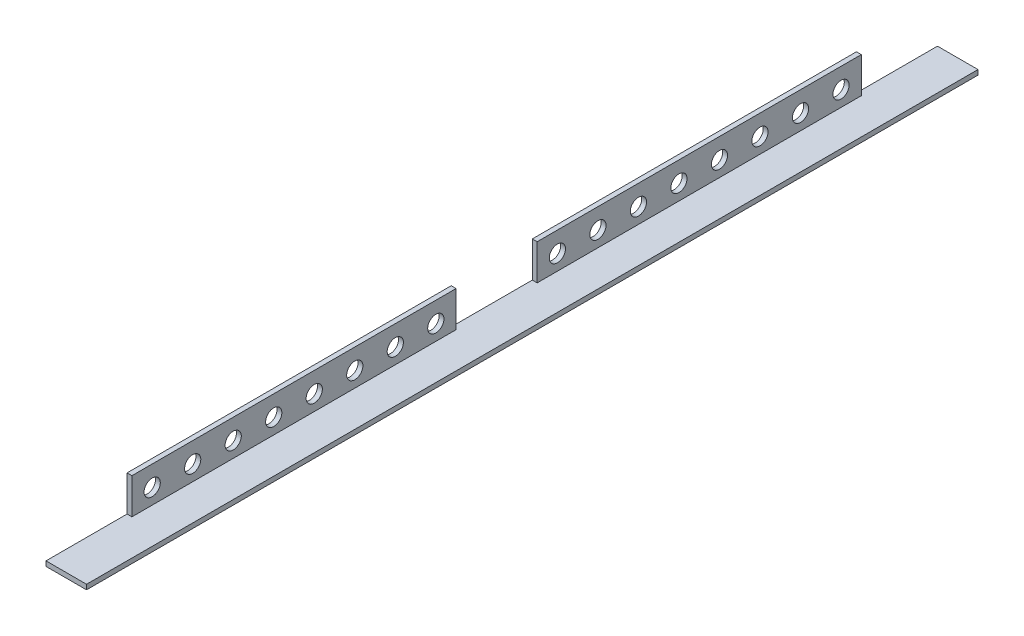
ISO-10303-21;
HEADER;
FILE_DESCRIPTION(('STEP AP214'),'2;1');
FILE_NAME('part.step','',(''),(''),'','','');
FILE_SCHEMA(('AUTOMOTIVE_DESIGN { 1 0 10303 214 1 1 1 1 }'));
ENDSEC;
DATA;
#1=APPLICATION_CONTEXT('core data for automotive mechanical design processes');
#2=APPLICATION_PROTOCOL_DEFINITION('international standard','automotive_design',2000,#1);
#3=PRODUCT_CONTEXT('',#1,'mechanical');
#4=PRODUCT('Part','Part','',(#3));
#5=PRODUCT_RELATED_PRODUCT_CATEGORY('part','',(#4));
#6=PRODUCT_DEFINITION_FORMATION('','',#4);
#7=PRODUCT_DEFINITION_CONTEXT('part definition',#1,'design');
#8=PRODUCT_DEFINITION('design','',#6,#7);
#9=PRODUCT_DEFINITION_SHAPE('','',#8);
#10=(LENGTH_UNIT() NAMED_UNIT(*) SI_UNIT(.MILLI.,.METRE.));
#11=(NAMED_UNIT(*) PLANE_ANGLE_UNIT() SI_UNIT($,.RADIAN.));
#12=(NAMED_UNIT(*) SI_UNIT($,.STERADIAN.) SOLID_ANGLE_UNIT());
#13=UNCERTAINTY_MEASURE_WITH_UNIT(LENGTH_MEASURE(1.E-05),#10,'distance_accuracy_value','');
#14=(GEOMETRIC_REPRESENTATION_CONTEXT(3) GLOBAL_UNCERTAINTY_ASSIGNED_CONTEXT((#13)) GLOBAL_UNIT_ASSIGNED_CONTEXT((#10,
#11,#12)) REPRESENTATION_CONTEXT('',''));
#15=CARTESIAN_POINT('',(0.,0.,0.));
#16=DIRECTION('',(0.,0.,1.));
#17=DIRECTION('',(1.,0.,0.));
#18=AXIS2_PLACEMENT_3D('',#15,#16,#17);
#19=CARTESIAN_POINT('',(-43.170695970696,0.,558.8));
#20=DIRECTION('',(0.,-1.,0.));
#21=DIRECTION('',(0.,0.,-1.));
#22=AXIS2_PLACEMENT_3D('',#19,#20,#21);
#23=PLANE('',#22);
#24=DIRECTION('',(0.,0.,-1.));
#25=VECTOR('',#24,1.);
#26=CARTESIAN_POINT('',(-40.122695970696,0.,558.8));
#27=LINE('',#26,#25);
#28=CARTESIAN_POINT('',(-40.122695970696,0.,254.));
#29=VERTEX_POINT('',#28);
#30=CARTESIAN_POINT('',(-40.122695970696,0.,50.8));
#31=VERTEX_POINT('',#30);
#32=EDGE_CURVE('E146',#29,#31,#27,.T.);
#33=ORIENTED_EDGE('',*,*,#32,.T.);
#34=DIRECTION('',(1.,0.,0.));
#35=VECTOR('',#34,1.);
#36=CARTESIAN_POINT('',(-598.922695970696,0.,50.8));
#37=LINE('',#36,#35);
#38=CARTESIAN_POINT('',(-43.170695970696,0.,50.8));
#39=VERTEX_POINT('',#38);
#40=EDGE_CURVE('E128',#39,#31,#37,.T.);
#41=ORIENTED_EDGE('',*,*,#40,.F.);
#42=DIRECTION('',(0.,0.,-1.));
#43=VECTOR('',#42,1.);
#44=CARTESIAN_POINT('',(-43.170695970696,0.,558.8));
#45=LINE('',#44,#43);
#46=CARTESIAN_POINT('',(-43.170695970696,0.,254.));
#47=VERTEX_POINT('',#46);
#48=EDGE_CURVE('E45',#47,#39,#45,.T.);
#49=ORIENTED_EDGE('',*,*,#48,.F.);
#50=DIRECTION('',(1.,0.,0.));
#51=VECTOR('',#50,1.);
#52=CARTESIAN_POINT('',(-598.922695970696,0.,254.));
#53=LINE('',#52,#51);
#54=EDGE_CURVE('E152',#47,#29,#53,.T.);
#55=ORIENTED_EDGE('',*,*,#54,.T.);
#56=EDGE_LOOP('',(#33,#41,#49,#55));
#57=FACE_BOUND('',#56,.T.);
#58=ADVANCED_FACE('F36',(#57),#23,.F.);
#59=CARTESIAN_POINT('',(-40.122695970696,0.,558.8));
#60=DIRECTION('',(-1.,0.,0.));
#61=DIRECTION('',(0.,0.,1.));
#62=AXIS2_PLACEMENT_3D('',#59,#60,#61);
#63=PLANE('',#62);
#64=CARTESIAN_POINT('',(-40.122695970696,-12.7,241.3));
#65=DIRECTION('',(-1.,0.,0.));
#66=DIRECTION('',(0.,0.,1.));
#67=AXIS2_PLACEMENT_3D('',#64,#65,#66);
#68=CIRCLE('',#67,5.07999999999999);
#69=CARTESIAN_POINT('',(-40.122695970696,-12.7,246.38));
#70=VERTEX_POINT('',#69);
#71=EDGE_CURVE('E599',#70,#70,#68,.T.);
#72=ORIENTED_EDGE('',*,*,#71,.T.);
#73=EDGE_LOOP('',(#72));
#74=FACE_BOUND('',#73,.T.);
#75=CARTESIAN_POINT('',(-40.122695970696,-12.7,215.9));
#76=DIRECTION('',(-1.,0.,0.));
#77=DIRECTION('',(0.,0.,1.));
#78=AXIS2_PLACEMENT_3D('',#75,#76,#77);
#79=CIRCLE('',#78,5.07999999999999);
#80=CARTESIAN_POINT('',(-40.122695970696,-12.7,220.98));
#81=VERTEX_POINT('',#80);
#82=EDGE_CURVE('E226',#81,#81,#79,.T.);
#83=ORIENTED_EDGE('',*,*,#82,.T.);
#84=EDGE_LOOP('',(#83));
#85=FACE_BOUND('',#84,.T.);
#86=CARTESIAN_POINT('',(-40.122695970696,-12.7,190.5));
#87=DIRECTION('',(-1.,0.,0.));
#88=DIRECTION('',(0.,0.,1.));
#89=AXIS2_PLACEMENT_3D('',#86,#87,#88);
#90=CIRCLE('',#89,5.07999999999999);
#91=CARTESIAN_POINT('',(-40.122695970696,-12.7,195.58));
#92=VERTEX_POINT('',#91);
#93=EDGE_CURVE('E232',#92,#92,#90,.T.);
#94=ORIENTED_EDGE('',*,*,#93,.T.);
#95=EDGE_LOOP('',(#94));
#96=FACE_BOUND('',#95,.T.);
#97=CARTESIAN_POINT('',(-40.122695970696,-12.7,165.1));
#98=DIRECTION('',(-1.,0.,0.));
#99=DIRECTION('',(0.,0.,1.));
#100=AXIS2_PLACEMENT_3D('',#97,#98,#99);
#101=CIRCLE('',#100,5.07999999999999);
#102=CARTESIAN_POINT('',(-40.122695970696,-12.7,170.18));
#103=VERTEX_POINT('',#102);
#104=EDGE_CURVE('E238',#103,#103,#101,.T.);
#105=ORIENTED_EDGE('',*,*,#104,.T.);
#106=EDGE_LOOP('',(#105));
#107=FACE_BOUND('',#106,.T.);
#108=CARTESIAN_POINT('',(-40.122695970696,-12.7,139.7));
#109=DIRECTION('',(-1.,0.,0.));
#110=DIRECTION('',(0.,0.,1.));
#111=AXIS2_PLACEMENT_3D('',#108,#109,#110);
#112=CIRCLE('',#111,5.07999999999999);
#113=CARTESIAN_POINT('',(-40.122695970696,-12.7,144.78));
#114=VERTEX_POINT('',#113);
#115=EDGE_CURVE('E244',#114,#114,#112,.T.);
#116=ORIENTED_EDGE('',*,*,#115,.T.);
#117=EDGE_LOOP('',(#116));
#118=FACE_BOUND('',#117,.T.);
#119=CARTESIAN_POINT('',(-40.122695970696,-12.7,114.3));
#120=DIRECTION('',(-1.,0.,0.));
#121=DIRECTION('',(0.,0.,1.));
#122=AXIS2_PLACEMENT_3D('',#119,#120,#121);
#123=CIRCLE('',#122,5.08);
#124=CARTESIAN_POINT('',(-40.122695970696,-12.7,119.38));
#125=VERTEX_POINT('',#124);
#126=EDGE_CURVE('E250',#125,#125,#123,.T.);
#127=ORIENTED_EDGE('',*,*,#126,.T.);
#128=EDGE_LOOP('',(#127));
#129=FACE_BOUND('',#128,.T.);
#130=CARTESIAN_POINT('',(-40.122695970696,-12.7,88.9));
#131=DIRECTION('',(-1.,0.,0.));
#132=DIRECTION('',(0.,0.,1.));
#133=AXIS2_PLACEMENT_3D('',#130,#131,#132);
#134=CIRCLE('',#133,5.08);
#135=CARTESIAN_POINT('',(-40.122695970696,-12.7,93.98));
#136=VERTEX_POINT('',#135);
#137=EDGE_CURVE('E256',#136,#136,#134,.T.);
#138=ORIENTED_EDGE('',*,*,#137,.T.);
#139=EDGE_LOOP('',(#138));
#140=FACE_BOUND('',#139,.T.);
#141=CARTESIAN_POINT('',(-40.122695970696,-12.7,63.5));
#142=DIRECTION('',(-1.,0.,0.));
#143=DIRECTION('',(0.,0.,1.));
#144=AXIS2_PLACEMENT_3D('',#141,#142,#143);
#145=CIRCLE('',#144,5.08);
#146=CARTESIAN_POINT('',(-40.122695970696,-12.7,68.58));
#147=VERTEX_POINT('',#146);
#148=EDGE_CURVE('E149',#147,#147,#145,.T.);
#149=ORIENTED_EDGE('',*,*,#148,.T.);
#150=EDGE_LOOP('',(#149));
#151=FACE_BOUND('',#150,.T.);
#152=DIRECTION('',(0.,0.,-1.));
#153=VECTOR('',#152,1.);
#154=CARTESIAN_POINT('',(-40.122695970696,-22.352,558.8));
#155=LINE('',#154,#153);
#156=CARTESIAN_POINT('',(-40.122695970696,-22.352,254.));
#157=VERTEX_POINT('',#156);
#158=CARTESIAN_POINT('',(-40.122695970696,-22.352,50.8));
#159=VERTEX_POINT('',#158);
#160=EDGE_CURVE('E148',#157,#159,#155,.T.);
#161=ORIENTED_EDGE('',*,*,#160,.T.);
#162=DIRECTION('',(0.,-1.,0.));
#163=VECTOR('',#162,1.);
#164=CARTESIAN_POINT('',(-40.122695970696,-22.352,50.8));
#165=LINE('',#164,#163);
#166=EDGE_CURVE('E132',#31,#159,#165,.T.);
#167=ORIENTED_EDGE('',*,*,#166,.F.);
#168=ORIENTED_EDGE('',*,*,#32,.F.);
#169=DIRECTION('',(0.,1.,0.));
#170=VECTOR('',#169,1.);
#171=CARTESIAN_POINT('',(-40.122695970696,-22.352,254.));
#172=LINE('',#171,#170);
#173=EDGE_CURVE('E271',#157,#29,#172,.T.);
#174=ORIENTED_EDGE('',*,*,#173,.F.);
#175=EDGE_LOOP('',(#161,#167,#168,#174));
#176=FACE_BOUND('',#175,.T.);
#177=ADVANCED_FACE('F144',(#74,#85,#96,#107,#118,#129,#140,#151,#176),#63,.F.);
#178=CARTESIAN_POINT('',(-40.122695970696,0.,508.));
#179=VERTEX_POINT('',#178);
#180=CARTESIAN_POINT('',(-40.122695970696,0.,304.8));
#181=VERTEX_POINT('',#180);
#182=EDGE_CURVE('E153',#179,#181,#27,.T.);
#183=ORIENTED_EDGE('',*,*,#182,.T.);
#184=DIRECTION('',(1.,0.,0.));
#185=VECTOR('',#184,1.);
#186=CARTESIAN_POINT('',(-598.922695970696,0.,304.8));
#187=LINE('',#186,#185);
#188=CARTESIAN_POINT('',(-43.170695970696,0.,304.8));
#189=VERTEX_POINT('',#188);
#190=EDGE_CURVE('E53',#189,#181,#187,.T.);
#191=ORIENTED_EDGE('',*,*,#190,.F.);
#192=CARTESIAN_POINT('',(-43.170695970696,0.,508.));
#193=VERTEX_POINT('',#192);
#194=EDGE_CURVE('E11',#193,#189,#45,.T.);
#195=ORIENTED_EDGE('',*,*,#194,.F.);
#196=DIRECTION('',(1.,0.,0.));
#197=VECTOR('',#196,1.);
#198=CARTESIAN_POINT('',(-598.922695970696,0.,508.));
#199=LINE('',#198,#197);
#200=EDGE_CURVE('E291',#193,#179,#199,.T.);
#201=ORIENTED_EDGE('',*,*,#200,.T.);
#202=EDGE_LOOP('',(#183,#191,#195,#201));
#203=FACE_BOUND('',#202,.T.);
#204=ADVANCED_FACE('F38',(#203),#23,.F.);
#205=CARTESIAN_POINT('',(-43.170695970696,0.,558.8));
#206=DIRECTION('',(1.,0.,0.));
#207=DIRECTION('',(0.,0.,-1.));
#208=AXIS2_PLACEMENT_3D('',#205,#206,#207);
#209=PLANE('',#208);
#210=CARTESIAN_POINT('',(-43.170695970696,-12.7,241.3));
#211=DIRECTION('',(-1.,0.,0.));
#212=DIRECTION('',(0.,0.,1.));
#213=AXIS2_PLACEMENT_3D('',#210,#211,#212);
#214=CIRCLE('',#213,5.07999999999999);
#215=CARTESIAN_POINT('',(-43.170695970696,-12.7,246.38));
#216=VERTEX_POINT('',#215);
#217=EDGE_CURVE('E596',#216,#216,#214,.T.);
#218=ORIENTED_EDGE('',*,*,#217,.F.);
#219=EDGE_LOOP('',(#218));
#220=FACE_BOUND('',#219,.T.);
#221=CARTESIAN_POINT('',(-43.170695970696,-12.7,495.3));
#222=DIRECTION('',(-1.,0.,0.));
#223=DIRECTION('',(0.,0.,1.));
#224=AXIS2_PLACEMENT_3D('',#221,#222,#223);
#225=CIRCLE('',#224,5.08000000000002);
#226=CARTESIAN_POINT('',(-43.170695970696,-12.7,500.38));
#227=VERTEX_POINT('',#226);
#228=EDGE_CURVE('E210',#227,#227,#225,.T.);
#229=ORIENTED_EDGE('',*,*,#228,.F.);
#230=EDGE_LOOP('',(#229));
#231=FACE_BOUND('',#230,.T.);
#232=CARTESIAN_POINT('',(-43.170695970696,-12.7,469.9));
#233=DIRECTION('',(-1.,0.,0.));
#234=DIRECTION('',(0.,0.,1.));
#235=AXIS2_PLACEMENT_3D('',#232,#233,#234);
#236=CIRCLE('',#235,5.07999999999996);
#237=CARTESIAN_POINT('',(-43.170695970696,-12.7,474.98));
#238=VERTEX_POINT('',#237);
#239=EDGE_CURVE('E200',#238,#238,#236,.T.);
#240=ORIENTED_EDGE('',*,*,#239,.F.);
#241=EDGE_LOOP('',(#240));
#242=FACE_BOUND('',#241,.T.);
#243=CARTESIAN_POINT('',(-43.170695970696,-12.7,444.5));
#244=DIRECTION('',(-1.,0.,0.));
#245=DIRECTION('',(0.,0.,1.));
#246=AXIS2_PLACEMENT_3D('',#243,#244,#245);
#247=CIRCLE('',#246,5.07999999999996);
#248=CARTESIAN_POINT('',(-43.170695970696,-12.7,449.58));
#249=VERTEX_POINT('',#248);
#250=EDGE_CURVE('E197',#249,#249,#247,.T.);
#251=ORIENTED_EDGE('',*,*,#250,.F.);
#252=EDGE_LOOP('',(#251));
#253=FACE_BOUND('',#252,.T.);
#254=CARTESIAN_POINT('',(-43.170695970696,-12.7,419.1));
#255=DIRECTION('',(-1.,0.,0.));
#256=DIRECTION('',(0.,0.,1.));
#257=AXIS2_PLACEMENT_3D('',#254,#255,#256);
#258=CIRCLE('',#257,5.07999999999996);
#259=CARTESIAN_POINT('',(-43.170695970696,-12.7,424.18));
#260=VERTEX_POINT('',#259);
#261=EDGE_CURVE('E194',#260,#260,#258,.T.);
#262=ORIENTED_EDGE('',*,*,#261,.F.);
#263=EDGE_LOOP('',(#262));
#264=FACE_BOUND('',#263,.T.);
#265=CARTESIAN_POINT('',(-43.170695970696,-12.7,393.7));
#266=DIRECTION('',(-1.,0.,0.));
#267=DIRECTION('',(0.,0.,1.));
#268=AXIS2_PLACEMENT_3D('',#265,#266,#267);
#269=CIRCLE('',#268,5.07999999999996);
#270=CARTESIAN_POINT('',(-43.170695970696,-12.7,398.78));
#271=VERTEX_POINT('',#270);
#272=EDGE_CURVE('E190',#271,#271,#269,.T.);
#273=ORIENTED_EDGE('',*,*,#272,.F.);
#274=EDGE_LOOP('',(#273));
#275=FACE_BOUND('',#274,.T.);
#276=CARTESIAN_POINT('',(-43.170695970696,-12.7,368.3));
#277=DIRECTION('',(-1.,0.,0.));
#278=DIRECTION('',(0.,0.,1.));
#279=AXIS2_PLACEMENT_3D('',#276,#277,#278);
#280=CIRCLE('',#279,5.07999999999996);
#281=CARTESIAN_POINT('',(-43.170695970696,-12.7,373.38));
#282=VERTEX_POINT('',#281);
#283=EDGE_CURVE('E186',#282,#282,#280,.T.);
#284=ORIENTED_EDGE('',*,*,#283,.F.);
#285=EDGE_LOOP('',(#284));
#286=FACE_BOUND('',#285,.T.);
#287=CARTESIAN_POINT('',(-43.170695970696,-12.7,342.9));
#288=DIRECTION('',(-1.,0.,0.));
#289=DIRECTION('',(0.,0.,1.));
#290=AXIS2_PLACEMENT_3D('',#287,#288,#289);
#291=CIRCLE('',#290,5.07999999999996);
#292=CARTESIAN_POINT('',(-43.170695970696,-12.7,347.98));
#293=VERTEX_POINT('',#292);
#294=EDGE_CURVE('E182',#293,#293,#291,.T.);
#295=ORIENTED_EDGE('',*,*,#294,.F.);
#296=EDGE_LOOP('',(#295));
#297=FACE_BOUND('',#296,.T.);
#298=CARTESIAN_POINT('',(-43.170695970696,-12.7,317.5));
#299=DIRECTION('',(-1.,0.,0.));
#300=DIRECTION('',(0.,0.,1.));
#301=AXIS2_PLACEMENT_3D('',#298,#299,#300);
#302=CIRCLE('',#301,5.07999999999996);
#303=CARTESIAN_POINT('',(-43.170695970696,-12.7,322.58));
#304=VERTEX_POINT('',#303);
#305=EDGE_CURVE('E178',#304,#304,#302,.T.);
#306=ORIENTED_EDGE('',*,*,#305,.F.);
#307=EDGE_LOOP('',(#306));
#308=FACE_BOUND('',#307,.T.);
#309=CARTESIAN_POINT('',(-43.170695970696,-12.7,215.9));
#310=DIRECTION('',(-1.,0.,0.));
#311=DIRECTION('',(0.,0.,1.));
#312=AXIS2_PLACEMENT_3D('',#309,#310,#311);
#313=CIRCLE('',#312,5.07999999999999);
#314=CARTESIAN_POINT('',(-43.170695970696,-12.7,220.98));
#315=VERTEX_POINT('',#314);
#316=EDGE_CURVE('E177',#315,#315,#313,.T.);
#317=ORIENTED_EDGE('',*,*,#316,.F.);
#318=EDGE_LOOP('',(#317));
#319=FACE_BOUND('',#318,.T.);
#320=CARTESIAN_POINT('',(-43.170695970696,-12.7,190.5));
#321=DIRECTION('',(-1.,0.,0.));
#322=DIRECTION('',(0.,0.,1.));
#323=AXIS2_PLACEMENT_3D('',#320,#321,#322);
#324=CIRCLE('',#323,5.07999999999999);
#325=CARTESIAN_POINT('',(-43.170695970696,-12.7,195.58));
#326=VERTEX_POINT('',#325);
#327=EDGE_CURVE('E229',#326,#326,#324,.T.);
#328=ORIENTED_EDGE('',*,*,#327,.F.);
#329=EDGE_LOOP('',(#328));
#330=FACE_BOUND('',#329,.T.);
#331=CARTESIAN_POINT('',(-43.170695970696,-12.7,165.1));
#332=DIRECTION('',(-1.,0.,0.));
#333=DIRECTION('',(0.,0.,1.));
#334=AXIS2_PLACEMENT_3D('',#331,#332,#333);
#335=CIRCLE('',#334,5.07999999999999);
#336=CARTESIAN_POINT('',(-43.170695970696,-12.7,170.18));
#337=VERTEX_POINT('',#336);
#338=EDGE_CURVE('E235',#337,#337,#335,.T.);
#339=ORIENTED_EDGE('',*,*,#338,.F.);
#340=EDGE_LOOP('',(#339));
#341=FACE_BOUND('',#340,.T.);
#342=CARTESIAN_POINT('',(-43.170695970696,-12.7,139.7));
#343=DIRECTION('',(-1.,0.,0.));
#344=DIRECTION('',(0.,0.,1.));
#345=AXIS2_PLACEMENT_3D('',#342,#343,#344);
#346=CIRCLE('',#345,5.07999999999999);
#347=CARTESIAN_POINT('',(-43.170695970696,-12.7,144.78));
#348=VERTEX_POINT('',#347);
#349=EDGE_CURVE('E241',#348,#348,#346,.T.);
#350=ORIENTED_EDGE('',*,*,#349,.F.);
#351=EDGE_LOOP('',(#350));
#352=FACE_BOUND('',#351,.T.);
#353=CARTESIAN_POINT('',(-43.170695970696,-12.7,114.3));
#354=DIRECTION('',(-1.,0.,0.));
#355=DIRECTION('',(0.,0.,1.));
#356=AXIS2_PLACEMENT_3D('',#353,#354,#355);
#357=CIRCLE('',#356,5.08);
#358=CARTESIAN_POINT('',(-43.170695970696,-12.7,119.38));
#359=VERTEX_POINT('',#358);
#360=EDGE_CURVE('E247',#359,#359,#357,.T.);
#361=ORIENTED_EDGE('',*,*,#360,.F.);
#362=EDGE_LOOP('',(#361));
#363=FACE_BOUND('',#362,.T.);
#364=CARTESIAN_POINT('',(-43.170695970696,-12.7,88.9));
#365=DIRECTION('',(-1.,0.,0.));
#366=DIRECTION('',(0.,0.,1.));
#367=AXIS2_PLACEMENT_3D('',#364,#365,#366);
#368=CIRCLE('',#367,5.08);
#369=CARTESIAN_POINT('',(-43.170695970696,-12.7,93.98));
#370=VERTEX_POINT('',#369);
#371=EDGE_CURVE('E253',#370,#370,#368,.T.);
#372=ORIENTED_EDGE('',*,*,#371,.F.);
#373=EDGE_LOOP('',(#372));
#374=FACE_BOUND('',#373,.T.);
#375=CARTESIAN_POINT('',(-43.170695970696,-12.7,63.5));
#376=DIRECTION('',(-1.,0.,0.));
#377=DIRECTION('',(0.,0.,1.));
#378=AXIS2_PLACEMENT_3D('',#375,#376,#377);
#379=CIRCLE('',#378,5.08);
#380=CARTESIAN_POINT('',(-43.170695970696,-12.7,68.58));
#381=VERTEX_POINT('',#380);
#382=EDGE_CURVE('E259',#381,#381,#379,.T.);
#383=ORIENTED_EDGE('',*,*,#382,.F.);
#384=EDGE_LOOP('',(#383));
#385=FACE_BOUND('',#384,.T.);
#386=DIRECTION('',(0.,-1.,0.));
#387=VECTOR('',#386,1.);
#388=CARTESIAN_POINT('',(-43.170695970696,0.,50.8));
#389=LINE('',#388,#387);
#390=CARTESIAN_POINT('',(-43.170695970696,-22.352,50.8));
#391=VERTEX_POINT('',#390);
#392=EDGE_CURVE('E135',#39,#391,#389,.T.);
#393=ORIENTED_EDGE('',*,*,#392,.T.);
#394=DIRECTION('',(0.,0.,-1.));
#395=VECTOR('',#394,1.);
#396=CARTESIAN_POINT('',(-43.170695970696,-22.3520000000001,558.8));
#397=LINE('',#396,#395);
#398=CARTESIAN_POINT('',(-43.170695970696,-22.352,0.));
#399=VERTEX_POINT('',#398);
#400=EDGE_CURVE('E264',#391,#399,#397,.T.);
#401=ORIENTED_EDGE('',*,*,#400,.T.);
#402=DIRECTION('',(0.,-1.,0.));
#403=VECTOR('',#402,1.);
#404=CARTESIAN_POINT('',(-43.170695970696,0.,0.));
#405=LINE('',#404,#403);
#406=CARTESIAN_POINT('',(-43.170695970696,-25.4,0.));
#407=VERTEX_POINT('',#406);
#408=EDGE_CURVE('E301',#399,#407,#405,.T.);
#409=ORIENTED_EDGE('',*,*,#408,.T.);
#410=DIRECTION('',(0.,0.,-1.));
#411=VECTOR('',#410,1.);
#412=CARTESIAN_POINT('',(-43.170695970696,-25.4,558.8));
#413=LINE('',#412,#411);
#414=CARTESIAN_POINT('',(-43.170695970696,-25.4,558.8));
#415=VERTEX_POINT('',#414);
#416=EDGE_CURVE('E171',#415,#407,#413,.T.);
#417=ORIENTED_EDGE('',*,*,#416,.F.);
#418=DIRECTION('',(0.,-1.,0.));
#419=VECTOR('',#418,1.);
#420=CARTESIAN_POINT('',(-43.170695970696,0.,558.8));
#421=LINE('',#420,#419);
#422=CARTESIAN_POINT('',(-43.170695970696,-22.352,558.8));
#423=VERTEX_POINT('',#422);
#424=EDGE_CURVE('E302',#423,#415,#421,.T.);
#425=ORIENTED_EDGE('',*,*,#424,.F.);
#426=DIRECTION('',(0.,0.,-1.));
#427=VECTOR('',#426,1.);
#428=CARTESIAN_POINT('',(-43.170695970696,-22.352,558.8));
#429=LINE('',#428,#427);
#430=CARTESIAN_POINT('',(-43.170695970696,-22.352,508.));
#431=VERTEX_POINT('',#430);
#432=EDGE_CURVE('E294',#423,#431,#429,.T.);
#433=ORIENTED_EDGE('',*,*,#432,.T.);
#434=DIRECTION('',(0.,1.,0.));
#435=VECTOR('',#434,1.);
#436=CARTESIAN_POINT('',(-43.170695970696,0.,508.));
#437=LINE('',#436,#435);
#438=EDGE_CURVE('E298',#431,#193,#437,.T.);
#439=ORIENTED_EDGE('',*,*,#438,.T.);
#440=ORIENTED_EDGE('',*,*,#194,.T.);
#441=DIRECTION('',(0.,-1.,0.));
#442=VECTOR('',#441,1.);
#443=CARTESIAN_POINT('',(-43.170695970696,0.,304.8));
#444=LINE('',#443,#442);
#445=CARTESIAN_POINT('',(-43.170695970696,-22.352,304.8));
#446=VERTEX_POINT('',#445);
#447=EDGE_CURVE('E274',#189,#446,#444,.T.);
#448=ORIENTED_EDGE('',*,*,#447,.T.);
#449=DIRECTION('',(0.,0.,-1.));
#450=VECTOR('',#449,1.);
#451=CARTESIAN_POINT('',(-43.170695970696,-22.352,558.8));
#452=LINE('',#451,#450);
#453=CARTESIAN_POINT('',(-43.170695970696,-22.352,254.));
#454=VERTEX_POINT('',#453);
#455=EDGE_CURVE('E282',#446,#454,#452,.T.);
#456=ORIENTED_EDGE('',*,*,#455,.T.);
#457=DIRECTION('',(0.,1.,0.));
#458=VECTOR('',#457,1.);
#459=CARTESIAN_POINT('',(-43.170695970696,0.,254.));
#460=LINE('',#459,#458);
#461=EDGE_CURVE('E285',#454,#47,#460,.T.);
#462=ORIENTED_EDGE('',*,*,#461,.T.);
#463=ORIENTED_EDGE('',*,*,#48,.T.);
#464=EDGE_LOOP('',(#393,#401,#409,#417,#425,#433,#439,#440,#448,#456,#462,#463));
#465=FACE_BOUND('',#464,.T.);
#466=ADVANCED_FACE('F319',(#220,#231,#242,#253,#264,#275,#286,#297,#308,#319,#330,#341,#352,
#363,#374,#385,#465),#209,.F.);
#467=CARTESIAN_POINT('',(-43.170695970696,-25.4,558.8));
#468=DIRECTION('',(0.,1.,0.));
#469=DIRECTION('',(0.,0.,1.));
#470=AXIS2_PLACEMENT_3D('',#467,#468,#469);
#471=PLANE('',#470);
#472=DIRECTION('',(1.,0.,0.));
#473=VECTOR('',#472,1.);
#474=CARTESIAN_POINT('',(-43.170695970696,-25.4,0.));
#475=LINE('',#474,#473);
#476=CARTESIAN_POINT('',(-17.770695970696,-25.4,0.));
#477=VERTEX_POINT('',#476);
#478=EDGE_CURVE('E308',#407,#477,#475,.T.);
#479=ORIENTED_EDGE('',*,*,#478,.T.);
#480=DIRECTION('',(0.,0.,-1.));
#481=VECTOR('',#480,1.);
#482=CARTESIAN_POINT('',(-17.770695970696,-25.4,558.8));
#483=LINE('',#482,#481);
#484=CARTESIAN_POINT('',(-17.770695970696,-25.4,558.8));
#485=VERTEX_POINT('',#484);
#486=EDGE_CURVE('E168',#485,#477,#483,.T.);
#487=ORIENTED_EDGE('',*,*,#486,.F.);
#488=DIRECTION('',(1.,0.,0.));
#489=VECTOR('',#488,1.);
#490=CARTESIAN_POINT('',(-43.170695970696,-25.4,558.8));
#491=LINE('',#490,#489);
#492=EDGE_CURVE('E304',#415,#485,#491,.T.);
#493=ORIENTED_EDGE('',*,*,#492,.F.);
#494=ORIENTED_EDGE('',*,*,#416,.T.);
#495=EDGE_LOOP('',(#479,#487,#493,#494));
#496=FACE_BOUND('',#495,.T.);
#497=ADVANCED_FACE('F325',(#496),#471,.F.);
#498=CARTESIAN_POINT('',(-17.770695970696,-22.352,558.8));
#499=DIRECTION('',(-1.,0.,0.));
#500=DIRECTION('',(0.,0.,1.));
#501=AXIS2_PLACEMENT_3D('',#498,#499,#500);
#502=PLANE('',#501);
#503=DIRECTION('',(0.,1.,0.));
#504=VECTOR('',#503,1.);
#505=CARTESIAN_POINT('',(-17.770695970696,-22.352,0.));
#506=LINE('',#505,#504);
#507=CARTESIAN_POINT('',(-17.770695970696,-22.352,0.));
#508=VERTEX_POINT('',#507);
#509=EDGE_CURVE('E309',#477,#508,#506,.T.);
#510=ORIENTED_EDGE('',*,*,#509,.T.);
#511=DIRECTION('',(0.,0.,-1.));
#512=VECTOR('',#511,1.);
#513=CARTESIAN_POINT('',(-17.770695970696,-22.352,558.8));
#514=LINE('',#513,#512);
#515=CARTESIAN_POINT('',(-17.770695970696,-22.352,558.8));
#516=VERTEX_POINT('',#515);
#517=EDGE_CURVE('E165',#516,#508,#514,.T.);
#518=ORIENTED_EDGE('',*,*,#517,.F.);
#519=DIRECTION('',(0.,1.,0.));
#520=VECTOR('',#519,1.);
#521=CARTESIAN_POINT('',(-17.770695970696,-22.352,558.8));
#522=LINE('',#521,#520);
#523=EDGE_CURVE('E156',#485,#516,#522,.T.);
#524=ORIENTED_EDGE('',*,*,#523,.F.);
#525=ORIENTED_EDGE('',*,*,#486,.T.);
#526=EDGE_LOOP('',(#510,#518,#524,#525));
#527=FACE_BOUND('',#526,.T.);
#528=ADVANCED_FACE('F328',(#527),#502,.F.);
#529=CARTESIAN_POINT('',(-40.122695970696,-22.352,558.8));
#530=DIRECTION('',(0.,-1.,0.));
#531=DIRECTION('',(0.,0.,-1.));
#532=AXIS2_PLACEMENT_3D('',#529,#530,#531);
#533=PLANE('',#532);
#534=DIRECTION('',(-1.,0.,0.));
#535=VECTOR('',#534,1.);
#536=CARTESIAN_POINT('',(-40.122695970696,-22.352,0.));
#537=LINE('',#536,#535);
#538=EDGE_CURVE('E160',#508,#399,#537,.T.);
#539=ORIENTED_EDGE('',*,*,#538,.T.);
#540=ORIENTED_EDGE('',*,*,#400,.F.);
#541=DIRECTION('',(1.,0.,0.));
#542=VECTOR('',#541,1.);
#543=CARTESIAN_POINT('',(-598.922695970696,-22.352,50.8));
#544=LINE('',#543,#542);
#545=EDGE_CURVE('E140',#391,#159,#544,.T.);
#546=ORIENTED_EDGE('',*,*,#545,.T.);
#547=ORIENTED_EDGE('',*,*,#160,.F.);
#548=DIRECTION('',(1.,0.,0.));
#549=VECTOR('',#548,1.);
#550=CARTESIAN_POINT('',(-598.922695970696,-22.352,254.));
#551=LINE('',#550,#549);
#552=EDGE_CURVE('E275',#454,#157,#551,.T.);
#553=ORIENTED_EDGE('',*,*,#552,.F.);
#554=ORIENTED_EDGE('',*,*,#455,.F.);
#555=DIRECTION('',(1.,0.,0.));
#556=VECTOR('',#555,1.);
#557=CARTESIAN_POINT('',(-598.922695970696,-22.352,304.8));
#558=LINE('',#557,#556);
#559=CARTESIAN_POINT('',(-40.122695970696,-22.352,304.8));
#560=VERTEX_POINT('',#559);
#561=EDGE_CURVE('E277',#446,#560,#558,.T.);
#562=ORIENTED_EDGE('',*,*,#561,.T.);
#563=CARTESIAN_POINT('',(-40.122695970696,-22.352,508.));
#564=VERTEX_POINT('',#563);
#565=EDGE_CURVE('E162',#564,#560,#155,.T.);
#566=ORIENTED_EDGE('',*,*,#565,.F.);
#567=DIRECTION('',(1.,0.,0.));
#568=VECTOR('',#567,1.);
#569=CARTESIAN_POINT('',(-598.922695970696,-22.352,508.));
#570=LINE('',#569,#568);
#571=EDGE_CURVE('E290',#431,#564,#570,.T.);
#572=ORIENTED_EDGE('',*,*,#571,.F.);
#573=ORIENTED_EDGE('',*,*,#432,.F.);
#574=DIRECTION('',(-1.,0.,0.));
#575=VECTOR('',#574,1.);
#576=CARTESIAN_POINT('',(-40.122695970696,-22.352,558.8));
#577=LINE('',#576,#575);
#578=EDGE_CURVE('E61',#516,#423,#577,.T.);
#579=ORIENTED_EDGE('',*,*,#578,.F.);
#580=ORIENTED_EDGE('',*,*,#517,.T.);
#581=EDGE_LOOP('',(#539,#540,#546,#547,#553,#554,#562,#566,#572,#573,#579,#580));
#582=FACE_BOUND('',#581,.T.);
#583=ADVANCED_FACE('F315',(#582),#533,.F.);
#584=CARTESIAN_POINT('',(-40.122695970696,-12.7,495.3));
#585=DIRECTION('',(-1.,0.,0.));
#586=DIRECTION('',(0.,0.,1.));
#587=AXIS2_PLACEMENT_3D('',#584,#585,#586);
#588=CIRCLE('',#587,5.08000000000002);
#589=CARTESIAN_POINT('',(-40.122695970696,-12.7,500.38));
#590=VERTEX_POINT('',#589);
#591=EDGE_CURVE('E40',#590,#590,#588,.T.);
#592=ORIENTED_EDGE('',*,*,#591,.T.);
#593=EDGE_LOOP('',(#592));
#594=FACE_BOUND('',#593,.T.);
#595=CARTESIAN_POINT('',(-40.122695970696,-12.7,469.9));
#596=DIRECTION('',(-1.,0.,0.));
#597=DIRECTION('',(0.,0.,1.));
#598=AXIS2_PLACEMENT_3D('',#595,#596,#597);
#599=CIRCLE('',#598,5.07999999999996);
#600=CARTESIAN_POINT('',(-40.122695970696,-12.7,474.98));
#601=VERTEX_POINT('',#600);
#602=EDGE_CURVE('E198',#601,#601,#599,.T.);
#603=ORIENTED_EDGE('',*,*,#602,.T.);
#604=EDGE_LOOP('',(#603));
#605=FACE_BOUND('',#604,.T.);
#606=CARTESIAN_POINT('',(-40.122695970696,-12.7,444.5));
#607=DIRECTION('',(-1.,0.,0.));
#608=DIRECTION('',(0.,0.,1.));
#609=AXIS2_PLACEMENT_3D('',#606,#607,#608);
#610=CIRCLE('',#609,5.07999999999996);
#611=CARTESIAN_POINT('',(-40.122695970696,-12.7,449.58));
#612=VERTEX_POINT('',#611);
#613=EDGE_CURVE('E195',#612,#612,#610,.T.);
#614=ORIENTED_EDGE('',*,*,#613,.T.);
#615=EDGE_LOOP('',(#614));
#616=FACE_BOUND('',#615,.T.);
#617=CARTESIAN_POINT('',(-40.122695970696,-12.7,419.1));
#618=DIRECTION('',(-1.,0.,0.));
#619=DIRECTION('',(0.,0.,1.));
#620=AXIS2_PLACEMENT_3D('',#617,#618,#619);
#621=CIRCLE('',#620,5.07999999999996);
#622=CARTESIAN_POINT('',(-40.122695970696,-12.7,424.18));
#623=VERTEX_POINT('',#622);
#624=EDGE_CURVE('E191',#623,#623,#621,.T.);
#625=ORIENTED_EDGE('',*,*,#624,.T.);
#626=EDGE_LOOP('',(#625));
#627=FACE_BOUND('',#626,.T.);
#628=CARTESIAN_POINT('',(-40.122695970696,-12.7,393.7));
#629=DIRECTION('',(-1.,0.,0.));
#630=DIRECTION('',(0.,0.,1.));
#631=AXIS2_PLACEMENT_3D('',#628,#629,#630);
#632=CIRCLE('',#631,5.07999999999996);
#633=CARTESIAN_POINT('',(-40.122695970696,-12.7,398.78));
#634=VERTEX_POINT('',#633);
#635=EDGE_CURVE('E187',#634,#634,#632,.T.);
#636=ORIENTED_EDGE('',*,*,#635,.T.);
#637=EDGE_LOOP('',(#636));
#638=FACE_BOUND('',#637,.T.);
#639=CARTESIAN_POINT('',(-40.122695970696,-12.7,368.3));
#640=DIRECTION('',(-1.,0.,0.));
#641=DIRECTION('',(0.,0.,1.));
#642=AXIS2_PLACEMENT_3D('',#639,#640,#641);
#643=CIRCLE('',#642,5.07999999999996);
#644=CARTESIAN_POINT('',(-40.122695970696,-12.7,373.38));
#645=VERTEX_POINT('',#644);
#646=EDGE_CURVE('E183',#645,#645,#643,.T.);
#647=ORIENTED_EDGE('',*,*,#646,.T.);
#648=EDGE_LOOP('',(#647));
#649=FACE_BOUND('',#648,.T.);
#650=CARTESIAN_POINT('',(-40.122695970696,-12.7,342.9));
#651=DIRECTION('',(-1.,0.,0.));
#652=DIRECTION('',(0.,0.,1.));
#653=AXIS2_PLACEMENT_3D('',#650,#651,#652);
#654=CIRCLE('',#653,5.07999999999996);
#655=CARTESIAN_POINT('',(-40.122695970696,-12.7,347.98));
#656=VERTEX_POINT('',#655);
#657=EDGE_CURVE('E179',#656,#656,#654,.T.);
#658=ORIENTED_EDGE('',*,*,#657,.T.);
#659=EDGE_LOOP('',(#658));
#660=FACE_BOUND('',#659,.T.);
#661=CARTESIAN_POINT('',(-40.122695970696,-12.7,317.5));
#662=DIRECTION('',(-1.,0.,0.));
#663=DIRECTION('',(0.,0.,1.));
#664=AXIS2_PLACEMENT_3D('',#661,#662,#663);
#665=CIRCLE('',#664,5.07999999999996);
#666=CARTESIAN_POINT('',(-40.122695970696,-12.7,322.58));
#667=VERTEX_POINT('',#666);
#668=EDGE_CURVE('E174',#667,#667,#665,.T.);
#669=ORIENTED_EDGE('',*,*,#668,.T.);
#670=EDGE_LOOP('',(#669));
#671=FACE_BOUND('',#670,.T.);
#672=ORIENTED_EDGE('',*,*,#565,.T.);
#673=DIRECTION('',(0.,-1.,0.));
#674=VECTOR('',#673,1.);
#675=CARTESIAN_POINT('',(-40.122695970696,0.,304.8));
#676=LINE('',#675,#674);
#677=EDGE_CURVE('E269',#181,#560,#676,.T.);
#678=ORIENTED_EDGE('',*,*,#677,.F.);
#679=ORIENTED_EDGE('',*,*,#182,.F.);
#680=DIRECTION('',(0.,1.,0.));
#681=VECTOR('',#680,1.);
#682=CARTESIAN_POINT('',(-40.122695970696,-22.352,508.));
#683=LINE('',#682,#681);
#684=EDGE_CURVE('E288',#564,#179,#683,.T.);
#685=ORIENTED_EDGE('',*,*,#684,.F.);
#686=EDGE_LOOP('',(#672,#678,#679,#685));
#687=FACE_BOUND('',#686,.T.);
#688=ADVANCED_FACE('F339',(#594,#605,#616,#627,#638,#649,#660,#671,#687),#63,.F.);
#689=CARTESIAN_POINT('',(0.,0.,558.8));
#690=DIRECTION('',(0.,0.,-1.));
#691=DIRECTION('',(-1.,0.,0.));
#692=AXIS2_PLACEMENT_3D('',#689,#690,#691);
#693=PLANE('',#692);
#694=ORIENTED_EDGE('',*,*,#578,.T.);
#695=ORIENTED_EDGE('',*,*,#424,.T.);
#696=ORIENTED_EDGE('',*,*,#492,.T.);
#697=ORIENTED_EDGE('',*,*,#523,.T.);
#698=EDGE_LOOP('',(#694,#695,#696,#697));
#699=FACE_BOUND('',#698,.T.);
#700=ADVANCED_FACE('F329',(#699),#693,.F.);
#701=CARTESIAN_POINT('',(0.,0.,0.));
#702=DIRECTION('',(0.,0.,-1.));
#703=DIRECTION('',(-1.,0.,0.));
#704=AXIS2_PLACEMENT_3D('',#701,#702,#703);
#705=PLANE('',#704);
#706=ORIENTED_EDGE('',*,*,#408,.F.);
#707=ORIENTED_EDGE('',*,*,#538,.F.);
#708=ORIENTED_EDGE('',*,*,#509,.F.);
#709=ORIENTED_EDGE('',*,*,#478,.F.);
#710=EDGE_LOOP('',(#706,#707,#708,#709));
#711=FACE_BOUND('',#710,.T.);
#712=ADVANCED_FACE('F322',(#711),#705,.T.);
#713=CARTESIAN_POINT('',(-598.922695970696,-22.352,508.));
#714=DIRECTION('',(0.,0.,-1.));
#715=DIRECTION('',(-1.,0.,0.));
#716=AXIS2_PLACEMENT_3D('',#713,#714,#715);
#717=PLANE('',#716);
#718=ORIENTED_EDGE('',*,*,#571,.T.);
#719=ORIENTED_EDGE('',*,*,#684,.T.);
#720=ORIENTED_EDGE('',*,*,#200,.F.);
#721=ORIENTED_EDGE('',*,*,#438,.F.);
#722=EDGE_LOOP('',(#718,#719,#720,#721));
#723=FACE_BOUND('',#722,.T.);
#724=ADVANCED_FACE('F336',(#723),#717,.F.);
#725=CARTESIAN_POINT('',(-598.922695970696,-22.352,254.));
#726=DIRECTION('',(0.,0.,-1.));
#727=DIRECTION('',(-1.,0.,0.));
#728=AXIS2_PLACEMENT_3D('',#725,#726,#727);
#729=PLANE('',#728);
#730=ORIENTED_EDGE('',*,*,#552,.T.);
#731=ORIENTED_EDGE('',*,*,#173,.T.);
#732=ORIENTED_EDGE('',*,*,#54,.F.);
#733=ORIENTED_EDGE('',*,*,#461,.F.);
#734=EDGE_LOOP('',(#730,#731,#732,#733));
#735=FACE_BOUND('',#734,.T.);
#736=ADVANCED_FACE('F345',(#735),#729,.F.);
#737=CARTESIAN_POINT('',(-598.922695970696,0.,304.8));
#738=DIRECTION('',(0.,0.,1.));
#739=DIRECTION('',(1.,0.,0.));
#740=AXIS2_PLACEMENT_3D('',#737,#738,#739);
#741=PLANE('',#740);
#742=ORIENTED_EDGE('',*,*,#190,.T.);
#743=ORIENTED_EDGE('',*,*,#677,.T.);
#744=ORIENTED_EDGE('',*,*,#561,.F.);
#745=ORIENTED_EDGE('',*,*,#447,.F.);
#746=EDGE_LOOP('',(#742,#743,#744,#745));
#747=FACE_BOUND('',#746,.T.);
#748=ADVANCED_FACE('F342',(#747),#741,.F.);
#749=CARTESIAN_POINT('',(-598.922695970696,-22.352,50.8));
#750=DIRECTION('',(0.,0.,1.));
#751=DIRECTION('',(1.,0.,0.));
#752=AXIS2_PLACEMENT_3D('',#749,#750,#751);
#753=PLANE('',#752);
#754=ORIENTED_EDGE('',*,*,#40,.T.);
#755=ORIENTED_EDGE('',*,*,#166,.T.);
#756=ORIENTED_EDGE('',*,*,#545,.F.);
#757=ORIENTED_EDGE('',*,*,#392,.F.);
#758=EDGE_LOOP('',(#754,#755,#756,#757));
#759=FACE_BOUND('',#758,.T.);
#760=ADVANCED_FACE('F130',(#759),#753,.F.);
#761=CARTESIAN_POINT('',(46.745304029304,-12.7,63.5));
#762=DIRECTION('',(-1.,0.,0.));
#763=DIRECTION('',(0.,0.,1.));
#764=AXIS2_PLACEMENT_3D('',#761,#762,#763);
#765=CYLINDRICAL_SURFACE('',#764,5.08);
#766=ORIENTED_EDGE('',*,*,#382,.T.);
#767=EDGE_LOOP('',(#766));
#768=FACE_BOUND('',#767,.T.);
#769=ORIENTED_EDGE('',*,*,#148,.F.);
#770=EDGE_LOOP('',(#769));
#771=FACE_BOUND('',#770,.T.);
#772=ADVANCED_FACE('F415',(#768,#771),#765,.F.);
#773=CARTESIAN_POINT('',(46.745304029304,-12.7,88.9));
#774=DIRECTION('',(-1.,0.,0.));
#775=DIRECTION('',(0.,0.,1.));
#776=AXIS2_PLACEMENT_3D('',#773,#774,#775);
#777=CYLINDRICAL_SURFACE('',#776,5.08);
#778=ORIENTED_EDGE('',*,*,#371,.T.);
#779=EDGE_LOOP('',(#778));
#780=FACE_BOUND('',#779,.T.);
#781=ORIENTED_EDGE('',*,*,#137,.F.);
#782=EDGE_LOOP('',(#781));
#783=FACE_BOUND('',#782,.T.);
#784=ADVANCED_FACE('F441',(#780,#783),#777,.F.);
#785=CARTESIAN_POINT('',(46.745304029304,-12.7,114.3));
#786=DIRECTION('',(-1.,0.,0.));
#787=DIRECTION('',(0.,0.,1.));
#788=AXIS2_PLACEMENT_3D('',#785,#786,#787);
#789=CYLINDRICAL_SURFACE('',#788,5.08);
#790=ORIENTED_EDGE('',*,*,#360,.T.);
#791=EDGE_LOOP('',(#790));
#792=FACE_BOUND('',#791,.T.);
#793=ORIENTED_EDGE('',*,*,#126,.F.);
#794=EDGE_LOOP('',(#793));
#795=FACE_BOUND('',#794,.T.);
#796=ADVANCED_FACE('F451',(#792,#795),#789,.F.);
#797=CARTESIAN_POINT('',(46.745304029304,-12.7,139.7));
#798=DIRECTION('',(-1.,0.,0.));
#799=DIRECTION('',(0.,0.,1.));
#800=AXIS2_PLACEMENT_3D('',#797,#798,#799);
#801=CYLINDRICAL_SURFACE('',#800,5.07999999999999);
#802=ORIENTED_EDGE('',*,*,#349,.T.);
#803=EDGE_LOOP('',(#802));
#804=FACE_BOUND('',#803,.T.);
#805=ORIENTED_EDGE('',*,*,#115,.F.);
#806=EDGE_LOOP('',(#805));
#807=FACE_BOUND('',#806,.T.);
#808=ADVANCED_FACE('F461',(#804,#807),#801,.F.);
#809=CARTESIAN_POINT('',(46.745304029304,-12.7,165.1));
#810=DIRECTION('',(-1.,0.,0.));
#811=DIRECTION('',(0.,0.,1.));
#812=AXIS2_PLACEMENT_3D('',#809,#810,#811);
#813=CYLINDRICAL_SURFACE('',#812,5.07999999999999);
#814=ORIENTED_EDGE('',*,*,#338,.T.);
#815=EDGE_LOOP('',(#814));
#816=FACE_BOUND('',#815,.T.);
#817=ORIENTED_EDGE('',*,*,#104,.F.);
#818=EDGE_LOOP('',(#817));
#819=FACE_BOUND('',#818,.T.);
#820=ADVANCED_FACE('F471',(#816,#819),#813,.F.);
#821=CARTESIAN_POINT('',(46.745304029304,-12.7,190.5));
#822=DIRECTION('',(-1.,0.,0.));
#823=DIRECTION('',(0.,0.,1.));
#824=AXIS2_PLACEMENT_3D('',#821,#822,#823);
#825=CYLINDRICAL_SURFACE('',#824,5.07999999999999);
#826=ORIENTED_EDGE('',*,*,#327,.T.);
#827=EDGE_LOOP('',(#826));
#828=FACE_BOUND('',#827,.T.);
#829=ORIENTED_EDGE('',*,*,#93,.F.);
#830=EDGE_LOOP('',(#829));
#831=FACE_BOUND('',#830,.T.);
#832=ADVANCED_FACE('F481',(#828,#831),#825,.F.);
#833=CARTESIAN_POINT('',(46.745304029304,-12.7,215.9));
#834=DIRECTION('',(-1.,0.,0.));
#835=DIRECTION('',(0.,0.,1.));
#836=AXIS2_PLACEMENT_3D('',#833,#834,#835);
#837=CYLINDRICAL_SURFACE('',#836,5.07999999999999);
#838=ORIENTED_EDGE('',*,*,#316,.T.);
#839=EDGE_LOOP('',(#838));
#840=FACE_BOUND('',#839,.T.);
#841=ORIENTED_EDGE('',*,*,#82,.F.);
#842=EDGE_LOOP('',(#841));
#843=FACE_BOUND('',#842,.T.);
#844=ADVANCED_FACE('F491',(#840,#843),#837,.F.);
#845=CARTESIAN_POINT('',(46.745304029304,-12.7,317.5));
#846=DIRECTION('',(-1.,0.,0.));
#847=DIRECTION('',(0.,0.,1.));
#848=AXIS2_PLACEMENT_3D('',#845,#846,#847);
#849=CYLINDRICAL_SURFACE('',#848,5.07999999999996);
#850=ORIENTED_EDGE('',*,*,#305,.T.);
#851=EDGE_LOOP('',(#850));
#852=FACE_BOUND('',#851,.T.);
#853=ORIENTED_EDGE('',*,*,#668,.F.);
#854=EDGE_LOOP('',(#853));
#855=FACE_BOUND('',#854,.T.);
#856=ADVANCED_FACE('F501',(#852,#855),#849,.F.);
#857=CARTESIAN_POINT('',(46.745304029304,-12.7,342.9));
#858=DIRECTION('',(-1.,0.,0.));
#859=DIRECTION('',(0.,0.,1.));
#860=AXIS2_PLACEMENT_3D('',#857,#858,#859);
#861=CYLINDRICAL_SURFACE('',#860,5.07999999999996);
#862=ORIENTED_EDGE('',*,*,#294,.T.);
#863=EDGE_LOOP('',(#862));
#864=FACE_BOUND('',#863,.T.);
#865=ORIENTED_EDGE('',*,*,#657,.F.);
#866=EDGE_LOOP('',(#865));
#867=FACE_BOUND('',#866,.T.);
#868=ADVANCED_FACE('F511',(#864,#867),#861,.F.);
#869=CARTESIAN_POINT('',(46.745304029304,-12.7,368.3));
#870=DIRECTION('',(-1.,0.,0.));
#871=DIRECTION('',(0.,0.,1.));
#872=AXIS2_PLACEMENT_3D('',#869,#870,#871);
#873=CYLINDRICAL_SURFACE('',#872,5.07999999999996);
#874=ORIENTED_EDGE('',*,*,#283,.T.);
#875=EDGE_LOOP('',(#874));
#876=FACE_BOUND('',#875,.T.);
#877=ORIENTED_EDGE('',*,*,#646,.F.);
#878=EDGE_LOOP('',(#877));
#879=FACE_BOUND('',#878,.T.);
#880=ADVANCED_FACE('F521',(#876,#879),#873,.F.);
#881=CARTESIAN_POINT('',(46.745304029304,-12.7,393.7));
#882=DIRECTION('',(-1.,0.,0.));
#883=DIRECTION('',(0.,0.,1.));
#884=AXIS2_PLACEMENT_3D('',#881,#882,#883);
#885=CYLINDRICAL_SURFACE('',#884,5.07999999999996);
#886=ORIENTED_EDGE('',*,*,#272,.T.);
#887=EDGE_LOOP('',(#886));
#888=FACE_BOUND('',#887,.T.);
#889=ORIENTED_EDGE('',*,*,#635,.F.);
#890=EDGE_LOOP('',(#889));
#891=FACE_BOUND('',#890,.T.);
#892=ADVANCED_FACE('F531',(#888,#891),#885,.F.);
#893=CARTESIAN_POINT('',(46.745304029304,-12.7,419.1));
#894=DIRECTION('',(-1.,0.,0.));
#895=DIRECTION('',(0.,0.,1.));
#896=AXIS2_PLACEMENT_3D('',#893,#894,#895);
#897=CYLINDRICAL_SURFACE('',#896,5.07999999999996);
#898=ORIENTED_EDGE('',*,*,#261,.T.);
#899=EDGE_LOOP('',(#898));
#900=FACE_BOUND('',#899,.T.);
#901=ORIENTED_EDGE('',*,*,#624,.F.);
#902=EDGE_LOOP('',(#901));
#903=FACE_BOUND('',#902,.T.);
#904=ADVANCED_FACE('F541',(#900,#903),#897,.F.);
#905=CARTESIAN_POINT('',(46.745304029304,-12.7,444.5));
#906=DIRECTION('',(-1.,0.,0.));
#907=DIRECTION('',(0.,0.,1.));
#908=AXIS2_PLACEMENT_3D('',#905,#906,#907);
#909=CYLINDRICAL_SURFACE('',#908,5.07999999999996);
#910=ORIENTED_EDGE('',*,*,#250,.T.);
#911=EDGE_LOOP('',(#910));
#912=FACE_BOUND('',#911,.T.);
#913=ORIENTED_EDGE('',*,*,#613,.F.);
#914=EDGE_LOOP('',(#913));
#915=FACE_BOUND('',#914,.T.);
#916=ADVANCED_FACE('F551',(#912,#915),#909,.F.);
#917=CARTESIAN_POINT('',(46.745304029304,-12.7,469.9));
#918=DIRECTION('',(-1.,0.,0.));
#919=DIRECTION('',(0.,0.,1.));
#920=AXIS2_PLACEMENT_3D('',#917,#918,#919);
#921=CYLINDRICAL_SURFACE('',#920,5.07999999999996);
#922=ORIENTED_EDGE('',*,*,#239,.T.);
#923=EDGE_LOOP('',(#922));
#924=FACE_BOUND('',#923,.T.);
#925=ORIENTED_EDGE('',*,*,#602,.F.);
#926=EDGE_LOOP('',(#925));
#927=FACE_BOUND('',#926,.T.);
#928=ADVANCED_FACE('F561',(#924,#927),#921,.F.);
#929=CARTESIAN_POINT('',(46.745304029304,-12.7,495.3));
#930=DIRECTION('',(-1.,0.,0.));
#931=DIRECTION('',(0.,0.,1.));
#932=AXIS2_PLACEMENT_3D('',#929,#930,#931);
#933=CYLINDRICAL_SURFACE('',#932,5.08000000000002);
#934=ORIENTED_EDGE('',*,*,#228,.T.);
#935=EDGE_LOOP('',(#934));
#936=FACE_BOUND('',#935,.T.);
#937=ORIENTED_EDGE('',*,*,#591,.F.);
#938=EDGE_LOOP('',(#937));
#939=FACE_BOUND('',#938,.T.);
#940=ADVANCED_FACE('F571',(#936,#939),#933,.F.);
#941=CARTESIAN_POINT('',(46.745304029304,-12.7,241.3));
#942=DIRECTION('',(-1.,0.,0.));
#943=DIRECTION('',(0.,0.,1.));
#944=AXIS2_PLACEMENT_3D('',#941,#942,#943);
#945=CYLINDRICAL_SURFACE('',#944,5.07999999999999);
#946=ORIENTED_EDGE('',*,*,#217,.T.);
#947=EDGE_LOOP('',(#946));
#948=FACE_BOUND('',#947,.T.);
#949=ORIENTED_EDGE('',*,*,#71,.F.);
#950=EDGE_LOOP('',(#949));
#951=FACE_BOUND('',#950,.T.);
#952=ADVANCED_FACE('F580',(#948,#951),#945,.F.);
#953=CLOSED_SHELL('',(#58,#177,#204,#466,#497,#528,#583,#688,#700,#712,#724,#736,#748,#760,#772,
#784,#796,#808,#820,#832,#844,#856,#868,#880,#892,#904,#916,#928,#940,#952));
#954=MANIFOLD_SOLID_BREP('B2',#953);
#955=ADVANCED_BREP_SHAPE_REPRESENTATION('',(#18,#954),#14);
#956=SHAPE_DEFINITION_REPRESENTATION(#9,#955);
ENDSEC;
END-ISO-10303-21;
